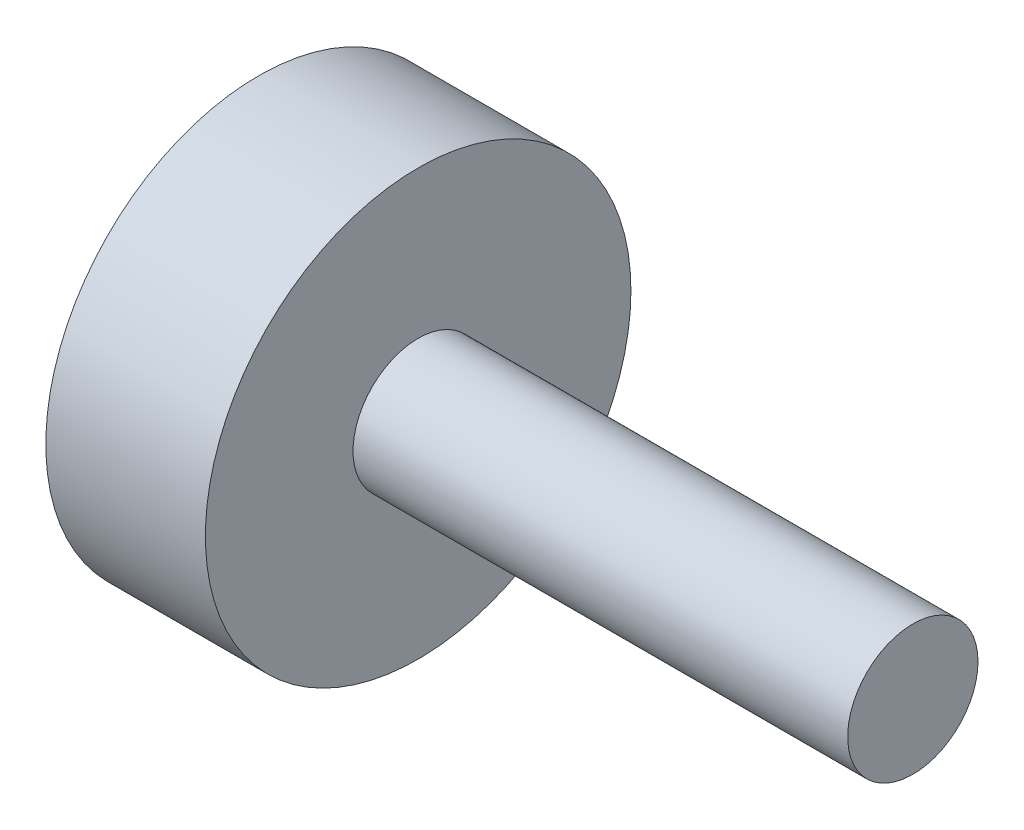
ISO-10303-21;
HEADER;
FILE_DESCRIPTION(('STEP AP214'),'2;1');
FILE_NAME('part.step','',(''),(''),'','','');
FILE_SCHEMA(('AUTOMOTIVE_DESIGN { 1 0 10303 214 1 1 1 1 }'));
ENDSEC;
DATA;
#1=APPLICATION_CONTEXT('core data for automotive mechanical design processes');
#2=APPLICATION_PROTOCOL_DEFINITION('international standard','automotive_design',2000,#1);
#3=PRODUCT_CONTEXT('',#1,'mechanical');
#4=PRODUCT('Part','Part','',(#3));
#5=PRODUCT_RELATED_PRODUCT_CATEGORY('part','',(#4));
#6=PRODUCT_DEFINITION_FORMATION('','',#4);
#7=PRODUCT_DEFINITION_CONTEXT('part definition',#1,'design');
#8=PRODUCT_DEFINITION('design','',#6,#7);
#9=PRODUCT_DEFINITION_SHAPE('','',#8);
#10=(LENGTH_UNIT() NAMED_UNIT(*) SI_UNIT(.MILLI.,.METRE.));
#11=(NAMED_UNIT(*) PLANE_ANGLE_UNIT() SI_UNIT($,.RADIAN.));
#12=(NAMED_UNIT(*) SI_UNIT($,.STERADIAN.) SOLID_ANGLE_UNIT());
#13=UNCERTAINTY_MEASURE_WITH_UNIT(LENGTH_MEASURE(1.E-05),#10,'distance_accuracy_value','');
#14=(GEOMETRIC_REPRESENTATION_CONTEXT(3) GLOBAL_UNCERTAINTY_ASSIGNED_CONTEXT((#13)) GLOBAL_UNIT_ASSIGNED_CONTEXT((#10,
#11,#12)) REPRESENTATION_CONTEXT('',''));
#15=CARTESIAN_POINT('',(0.,0.,0.));
#16=DIRECTION('',(0.,0.,1.));
#17=DIRECTION('',(1.,0.,0.));
#18=AXIS2_PLACEMENT_3D('',#15,#16,#17);
#19=CARTESIAN_POINT('',(3.,0.,0.));
#20=DIRECTION('',(1.,0.,0.));
#21=DIRECTION('',(0.,0.,-1.));
#22=AXIS2_PLACEMENT_3D('',#19,#20,#21);
#23=PLANE('',#22);
#24=CARTESIAN_POINT('',(3.,0.,0.));
#25=DIRECTION('',(1.,0.,0.));
#26=DIRECTION('',(0.,0.,-1.));
#27=AXIS2_PLACEMENT_3D('',#24,#25,#26);
#28=CIRCLE('',#27,1.225);
#29=CARTESIAN_POINT('',(3.,0.,-1.225));
#30=VERTEX_POINT('',#29);
#31=EDGE_CURVE('E50',#30,#30,#28,.T.);
#32=ORIENTED_EDGE('',*,*,#31,.F.);
#33=EDGE_LOOP('',(#32));
#34=FACE_BOUND('',#33,.T.);
#35=CARTESIAN_POINT('',(3.,0.,0.));
#36=DIRECTION('',(1.,0.,0.));
#37=DIRECTION('',(0.,0.,-1.));
#38=AXIS2_PLACEMENT_3D('',#35,#36,#37);
#39=CIRCLE('',#38,4.);
#40=CARTESIAN_POINT('',(3.,0.,-4.));
#41=VERTEX_POINT('',#40);
#42=EDGE_CURVE('E10',#41,#41,#39,.T.);
#43=ORIENTED_EDGE('',*,*,#42,.T.);
#44=EDGE_LOOP('',(#43));
#45=FACE_BOUND('',#44,.T.);
#46=ADVANCED_FACE('F31',(#34,#45),#23,.T.);
#47=CARTESIAN_POINT('',(0.,0.,0.));
#48=DIRECTION('',(1.,0.,0.));
#49=DIRECTION('',(0.,0.,-1.));
#50=AXIS2_PLACEMENT_3D('',#47,#48,#49);
#51=PLANE('',#50);
#52=CARTESIAN_POINT('',(0.,0.,0.));
#53=DIRECTION('',(1.,0.,0.));
#54=DIRECTION('',(0.,0.,-1.));
#55=AXIS2_PLACEMENT_3D('',#52,#53,#54);
#56=CIRCLE('',#55,4.);
#57=CARTESIAN_POINT('',(0.,0.,-4.));
#58=VERTEX_POINT('',#57);
#59=EDGE_CURVE('E35',#58,#58,#56,.T.);
#60=ORIENTED_EDGE('',*,*,#59,.F.);
#61=EDGE_LOOP('',(#60));
#62=FACE_BOUND('',#61,.T.);
#63=CARTESIAN_POINT('',(0.,0.,0.));
#64=DIRECTION('',(1.,0.,0.));
#65=DIRECTION('',(0.,0.,-1.));
#66=AXIS2_PLACEMENT_3D('',#63,#64,#65);
#67=CIRCLE('',#66,1.025);
#68=CARTESIAN_POINT('',(0.,0.,-1.025));
#69=VERTEX_POINT('',#68);
#70=EDGE_CURVE('E42',#69,#69,#67,.T.);
#71=ORIENTED_EDGE('',*,*,#70,.T.);
#72=EDGE_LOOP('',(#71));
#73=FACE_BOUND('',#72,.T.);
#74=ADVANCED_FACE('F66',(#62,#73),#51,.F.);
#75=CARTESIAN_POINT('',(3.,0.,0.));
#76=DIRECTION('',(-1.,0.,0.));
#77=DIRECTION('',(0.,0.,1.));
#78=AXIS2_PLACEMENT_3D('',#75,#76,#77);
#79=CYLINDRICAL_SURFACE('',#78,4.);
#80=ORIENTED_EDGE('',*,*,#42,.F.);
#81=EDGE_LOOP('',(#80));
#82=FACE_BOUND('',#81,.T.);
#83=ORIENTED_EDGE('',*,*,#59,.T.);
#84=EDGE_LOOP('',(#83));
#85=FACE_BOUND('',#84,.T.);
#86=ADVANCED_FACE('F33',(#82,#85),#79,.T.);
#87=CARTESIAN_POINT('',(3.,0.,0.));
#88=DIRECTION('',(-1.,0.,0.));
#89=DIRECTION('',(0.,0.,1.));
#90=AXIS2_PLACEMENT_3D('',#87,#88,#89);
#91=CYLINDRICAL_SURFACE('',#90,1.025);
#92=CARTESIAN_POINT('',(3.,0.,0.));
#93=DIRECTION('',(1.,0.,0.));
#94=DIRECTION('',(0.,0.,-1.));
#95=AXIS2_PLACEMENT_3D('',#92,#93,#94);
#96=CIRCLE('',#95,1.025);
#97=CARTESIAN_POINT('',(3.,0.,-1.025));
#98=VERTEX_POINT('',#97);
#99=EDGE_CURVE('E46',#98,#98,#96,.T.);
#100=ORIENTED_EDGE('',*,*,#99,.T.);
#101=EDGE_LOOP('',(#100));
#102=FACE_BOUND('',#101,.T.);
#103=ORIENTED_EDGE('',*,*,#70,.F.);
#104=EDGE_LOOP('',(#103));
#105=FACE_BOUND('',#104,.T.);
#106=ADVANCED_FACE('F73',(#102,#105),#91,.F.);
#107=CARTESIAN_POINT('',(3.,0.,0.));
#108=DIRECTION('',(1.,0.,0.));
#109=DIRECTION('',(0.,0.,-1.));
#110=AXIS2_PLACEMENT_3D('',#107,#108,#109);
#111=PLANE('',#110);
#112=ORIENTED_EDGE('',*,*,#99,.F.);
#113=EDGE_LOOP('',(#112));
#114=FACE_BOUND('',#113,.T.);
#115=ADVANCED_FACE('F61',(#114),#111,.F.);
#116=CARTESIAN_POINT('',(12.3,0.,0.));
#117=DIRECTION('',(-1.,0.,0.));
#118=DIRECTION('',(0.,0.,1.));
#119=AXIS2_PLACEMENT_3D('',#116,#117,#118);
#120=CYLINDRICAL_SURFACE('',#119,1.225);
#121=CARTESIAN_POINT('',(12.3,0.,0.));
#122=DIRECTION('',(1.,0.,0.));
#123=DIRECTION('',(0.,0.,-1.));
#124=AXIS2_PLACEMENT_3D('',#121,#122,#123);
#125=CIRCLE('',#124,1.225);
#126=CARTESIAN_POINT('',(12.3,0.,-1.225));
#127=VERTEX_POINT('',#126);
#128=EDGE_CURVE('E49',#127,#127,#125,.T.);
#129=ORIENTED_EDGE('',*,*,#128,.F.);
#130=EDGE_LOOP('',(#129));
#131=FACE_BOUND('',#130,.T.);
#132=ORIENTED_EDGE('',*,*,#31,.T.);
#133=EDGE_LOOP('',(#132));
#134=FACE_BOUND('',#133,.T.);
#135=ADVANCED_FACE('F58',(#131,#134),#120,.T.);
#136=CARTESIAN_POINT('',(12.3,0.,0.));
#137=DIRECTION('',(1.,0.,0.));
#138=DIRECTION('',(0.,0.,-1.));
#139=AXIS2_PLACEMENT_3D('',#136,#137,#138);
#140=PLANE('',#139);
#141=ORIENTED_EDGE('',*,*,#128,.T.);
#142=EDGE_LOOP('',(#141));
#143=FACE_BOUND('',#142,.T.);
#144=ADVANCED_FACE('F56',(#143),#140,.T.);
#145=CLOSED_SHELL('',(#46,#74,#86,#106,#115,#135,#144));
#146=MANIFOLD_SOLID_BREP('B2',#145);
#147=ADVANCED_BREP_SHAPE_REPRESENTATION('',(#18,#146),#14);
#148=SHAPE_DEFINITION_REPRESENTATION(#9,#147);
ENDSEC;
END-ISO-10303-21;
